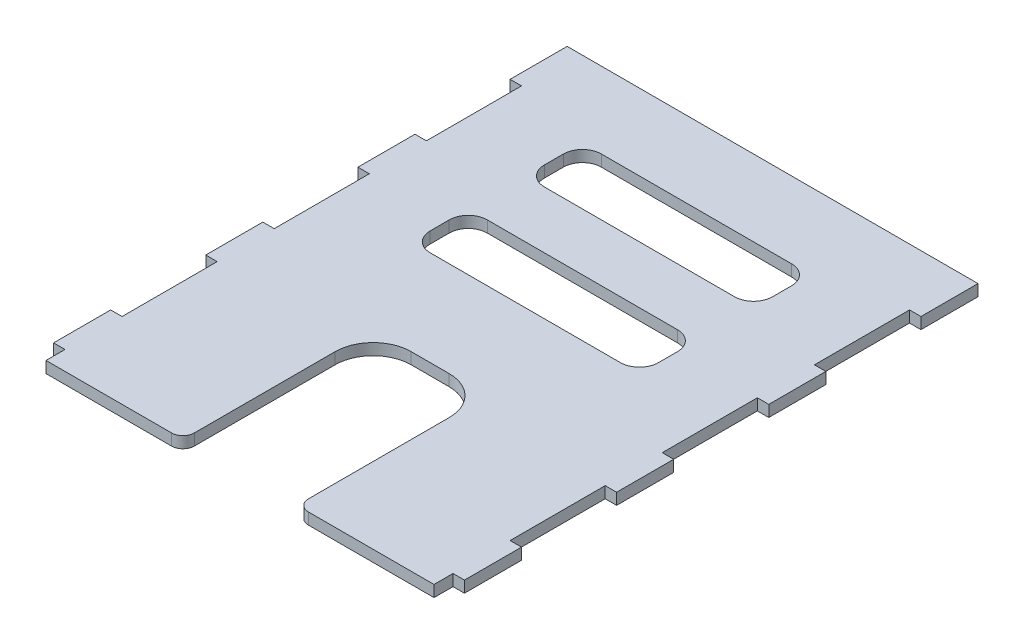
from build123d import *

# Parameters (mm, degrees)
SKETCH1_W           = 102
SKETCH1_H           = 145
BOSS_EXTRUDE1_DEPTH = 3
SKETCH2_W           = 3
SKETCH2_H           = 15
BOSS_EXTRUDE2_DEPTH = 3
SKETCH3_W           = 30
SKETCH3_H           = 50
CUT_EXTRUDE1_DEPTH  = 10
FILLET1_R           = 10
FILLET2_R           = 3
SKETCH4_W           = 60
SKETCH4_H           = 15
CUT_EXTRUDE2_DEPTH  = 10
FILLET3_R           = 5
SKETCH5_W           = 102
SKETCH5_H           = 5
CUT_EXTRUDE3_DEPTH  = 10


with BuildPart() as part:
    # Sketch1 → Boss-Extrude1 (new body)
    with BuildSketch(Plane(origin=(0, 0, 0), x_dir=(1, 0, 0), z_dir=(0, 1, 0))):
        with Locations((51, 72.5)):
            Rectangle(SKETCH1_W, SKETCH1_H)
    extrude(amount=BOSS_EXTRUDE1_DEPTH)

    # Sketch2 → Boss-Extrude2 (add)
    with BuildSketch(Plane(origin=(0, 3, 0), x_dir=(1, 0, 0), z_dir=(0, 1, 0))):
        with Locations((103.5, 132.5)):
            Rectangle(SKETCH2_W, SKETCH2_H)
        with Locations((103.5, 92.5)):
            Rectangle(SKETCH2_W, SKETCH2_H)
        with Locations((103.5, 52.5)):
            Rectangle(SKETCH2_W, SKETCH2_H)
        with Locations((103.5, 12.5)):
            Rectangle(SKETCH2_W, SKETCH2_H)
        with Locations((-1.5, 12.5)):
            Rectangle(SKETCH2_W, SKETCH2_H)
        with Locations((-1.5, 52.5)):
            Rectangle(SKETCH2_W, SKETCH2_H)
        with Locations((-1.5, 92.5)):
            Rectangle(SKETCH2_W, SKETCH2_H)
        with Locations((-1.5, 132.5)):
            Rectangle(SKETCH2_W, SKETCH2_H)
    extrude(amount=-BOSS_EXTRUDE2_DEPTH)

    # Sketch3 → Cut-Extrude1 (cut)
    with BuildSketch(Plane(origin=(0, 3, 0), x_dir=(1, 0, 0), z_dir=(0, 1, 0))):
        with Locations((51, 25)):
            Rectangle(SKETCH3_W, SKETCH3_H)
    extrude(amount=-CUT_EXTRUDE1_DEPTH, mode=Mode.SUBTRACT)

    # Fillet1
    fillet1_edges = [part.edges().sort_by_distance(p)[0] for p in [
        (36, 1.5, -50),
        (66, 1.5, -50),
    ]]
    fillet(fillet1_edges, radius=FILLET1_R)

    # Fillet2
    fillet2_edges = [part.edges().sort_by_distance(p)[0] for p in [
        (66, 1.5, 0),
        (36, 1.5, 0),
    ]]
    fillet(fillet2_edges, radius=FILLET2_R)

    # Sketch4 → Cut-Extrude2 (cut)
    with BuildSketch(Plane(origin=(0, 3, 0), x_dir=(1, 0, 0), z_dir=(0, 1, 0))):
        with Locations((51, 112.5)):
            Rectangle(SKETCH4_W, SKETCH4_H)
        with Locations((51, 82.5)):
            Rectangle(SKETCH4_W, SKETCH4_H)
    extrude(amount=-CUT_EXTRUDE2_DEPTH, mode=Mode.SUBTRACT)

    # Fillet3
    fillet3_edges = [part.edges().sort_by_distance(p)[0] for p in [
        (21, 1.5, -105),
        (21, 1.5, -120),
        (81, 1.5, -120),
        (81, 1.5, -105),
        (21, 1.5, -90),
        (81, 1.5, -90),
        (81, 1.5, -75),
        (21, 1.5, -75),
    ]]
    fillet(fillet3_edges, radius=FILLET3_R)

    # Sketch5 → Cut-Extrude3 (cut)
    with BuildSketch(Plane(origin=(0, 3, 0), x_dir=(1, 0, 0), z_dir=(0, 1, 0))):
        with Locations((51, 142.5)):
            Rectangle(SKETCH5_W, SKETCH5_H)
    extrude(amount=-CUT_EXTRUDE3_DEPTH, mode=Mode.SUBTRACT)


solid = part.part
